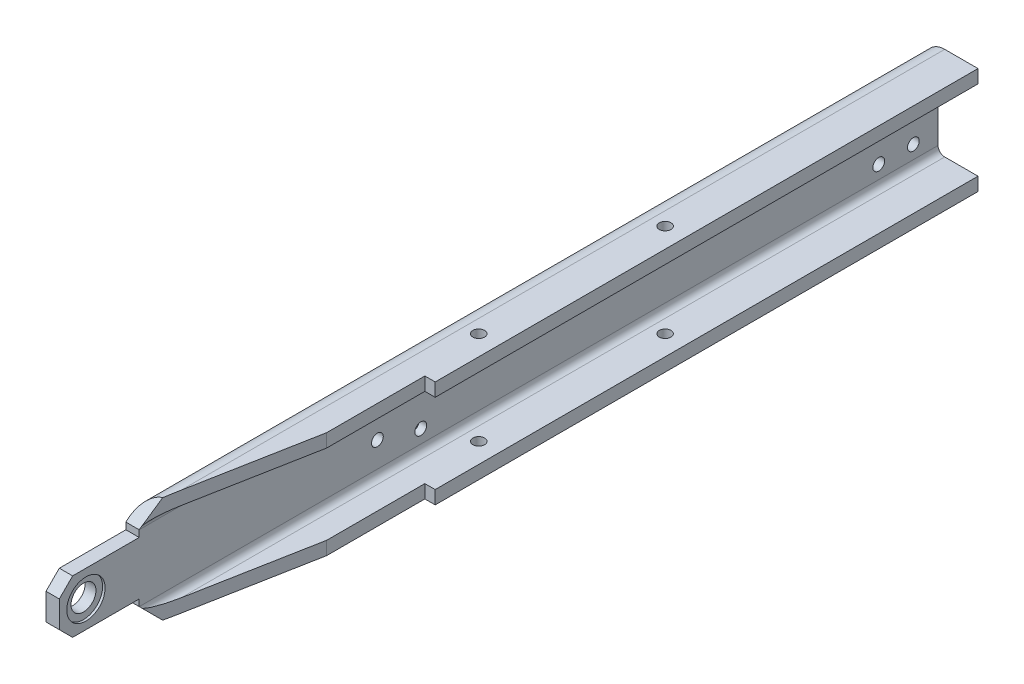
from build123d import *

# Parameters (mm, degrees)
BASE_EXTRUDE_DEPTH                                 = 431.8
SKETCH2_W                                          = 26.565487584
SKETCH2_H                                          = 13.18919361
SKETCH2_W_2                                        = 26.605763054
SKETCH2_H_2                                        = 13.278530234
CUT_EXTRUDE1_DEPTH                                 = 38.1
CUT_EXTRUDE2_DEPTH                                 = 436.519276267
SKETCH4_R                                          = 5.953125
CUT_EXTRUDE3_DEPTH                                 = 433.965705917
CHAMFER1_SIZE                                      = 6.35
CUT_EXTRUDE6_DEPTH                                 = 433.965705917
CUT_EXTRUDE6_DEPTH_BACK                            = 433.965705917
SKETCH6_R                                          = 2.794
FOAM_MOUNT_HOLES_DEPTH                             = 436.519276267
SKETCH7_R                                          = 9.1313
SKETCH7_R_2                                        = 4.7625
CONE_MOUNT_HOLES_DEPTH                             = 1.1684
SKETCH8_R                                          = 2.794
FRAME_MOUNT_HOLES_DEPTH                            = 434.291541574
SKETCH10_W                                         = 25.4
SKETCH10_H                                         = 12.7
SHORTEN_LENGTH_DEPTH                               = 436.519276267
CSK_FOR_10_FLAT_HEAD_SOCKET_CAP_SCREW1_D           = 5.6134
CSK_FOR_10_FLAT_HEAD_SOCKET_CAP_SCREW1_DEPTH       = 25.4
CSK_FOR_10_FLAT_HEAD_SOCKET_CAP_SCREW1_CSINK_D     = 10.4394
CSK_FOR_10_FLAT_HEAD_SOCKET_CAP_SCREW1_CSINK_ANGLE = 82
CSK_FOR_10_FLAT_HEAD_SOCKET_CAP_SCREW1_TIP         = 1.686435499
HOLE1_D                                            = 5.6134
HOLE1_DEPTH                                        = 25.4
HOLE1_CSINK_D                                      = 10.4394
HOLE1_CSINK_ANGLE                                  = 82
HOLE1_TIP                                          = 1.686435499
SKETCH16_R                                         = 2.8067
ELECBRKTMOUNT_DEPTH                                = 15.24
SKETCH17_R                                         = 2.8067
CUT_EXTRUDE7_DEPTH                                 = 433.965705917
CUT_EXTRUDE8_DEPTH                                 = 436.519276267


with BuildPart() as part:
    # Sketch1 → Base-Extrude (new body)
    with BuildSketch(Plane.XY):
        with BuildLine():
            Line((0, -15.875), (0, 15.875))
            ThreePointArc((0, 15.875), (2.789807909, 22.610192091), (9.525, 25.4))
            Line((9.525, 25.4), (25.4, 25.4))
            Line((25.4, 25.4), (25.4, 19.05))
            Line((25.4, 19.05), (9.525, 19.05))
            ThreePointArc((9.525, 19.05), (7.27993597, 18.12006403), (6.35, 15.875))
            Line((6.35, 15.875), (6.35, -15.875))
            ThreePointArc((6.35, -15.875), (7.27993597, -18.12006403), (9.525, -19.05))
            Line((9.525, -19.05), (25.4, -19.05))
            Line((25.4, -19.05), (25.4, -25.4))
            Line((25.4, -25.4), (9.525, -25.4))
            ThreePointArc((9.525, -25.4), (2.789807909, -22.610192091), (0, -15.875))
        make_face()
    extrude(amount=BASE_EXTRUDE_DEPTH)

    # Sketch2 → Cut-Extrude1 (cut)
    with BuildSketch(Plane.XY.offset(431.8)):
        with Locations((13.282743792, 19.294596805)):
            Rectangle(SKETCH2_W, SKETCH2_H)
        with Locations((13.302881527, -19.339265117)):
            Rectangle(SKETCH2_W_2, SKETCH2_H_2)
    extrude(amount=-CUT_EXTRUDE1_DEPTH, mode=Mode.SUBTRACT)

    # Sketch3 → Cut-Extrude2 (cut, through all)
    with BuildSketch(Plane(origin=(0, 25.4, 0), x_dir=(-1, 0, 0), z_dir=(0, 1, 0))):
        Polygon((-6.35, 393.7), (-25.4, 292.1), (-25.4, 393.7), align=None)
    extrude(amount=-CUT_EXTRUDE2_DEPTH, mode=Mode.SUBTRACT)

    # Sketch4 → Cut-Extrude3 (cut, through all)
    with BuildSketch(Plane(origin=(6.35, 0, 0), x_dir=(0, 0, -1), z_dir=(1, 0, 0))):
        with Locations((-419.1, 0)):
            Circle(SKETCH4_R)
    extrude(amount=-CUT_EXTRUDE3_DEPTH, mode=Mode.SUBTRACT)

    # Chamfer1
    chamfer1_edges = [part.edges().sort_by_distance(p)[0] for p in [
        (3.175, -12.7, 431.8),
        (3.175, 12.7, 431.8),
    ]]
    chamfer(chamfer1_edges, length=CHAMFER1_SIZE)

    # Sketch5 → Cut-Extrude6 (cut, two sides: drawn at the far end of the back side and taken through both)
    with BuildSketch(Plane(origin=(6.35, 0, 0), x_dir=(0, 0, -1), z_dir=(1, 0, 0)).offset(-CUT_EXTRUDE6_DEPTH_BACK)):
        Polygon((-393.7, 15.875), (-393.7, 28.575), (-381, 28.575), align=None)
        Polygon((-393.7, -15.875), (-393.7, -28.575), (-381, -28.575), align=None)
    extrude(amount=CUT_EXTRUDE6_DEPTH + CUT_EXTRUDE6_DEPTH_BACK, mode=Mode.SUBTRACT)

    # Sketch6 → foam mount holes (cut, through all)
    with BuildSketch(Plane.XZ.offset(25.4)):
        with Locations((15.875, 241.3)):
            Circle(SKETCH6_R)
        with Locations((15.875, 152.4)):
            Circle(SKETCH6_R)
    extrude(amount=-FOAM_MOUNT_HOLES_DEPTH, mode=Mode.SUBTRACT)

    # Sketch7 → cone mount holes (cut)
    with BuildSketch(Plane(origin=(6.35, 0, 0), x_dir=(0, 0, -1), z_dir=(1, 0, 0))):
        with Locations((-419.1, 0)):
            Circle(SKETCH7_R)
        with Locations((-419.1, 0)):
            Circle(SKETCH7_R_2, mode=Mode.SUBTRACT)
    extrude(amount=-CONE_MOUNT_HOLES_DEPTH, mode=Mode.SUBTRACT)

    # Sketch8 → frame mount holes (cut, through all)
    with BuildSketch(Plane.ZY):
        with Locations((259.419244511, 9.525)):
            Circle(SKETCH8_R)
        with Locations((259.419244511, -9.525)):
            Circle(SKETCH8_R)
        with Locations((24.469244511, 9.525)):
            Circle(SKETCH8_R)
        with Locations((24.469244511, -9.525)):
            Circle(SKETCH8_R)
    extrude(amount=-FRAME_MOUNT_HOLES_DEPTH, mode=Mode.SUBTRACT)

    # Sketch10 → shorten length (cut, through all)
    with BuildSketch(Plane(origin=(0, 25.4, 0), x_dir=(-1, 0, 0), z_dir=(0, 1, 0))):
        with Locations((-12.7, 6.35)):
            Rectangle(SKETCH10_W, SKETCH10_H)
    extrude(amount=-SHORTEN_LENGTH_DEPTH, mode=Mode.SUBTRACT)

    # CSK for _10 Flat Head Socket Cap Screw1
    with Locations(Plane.ZY):
        with Locations((259.419244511, 9.525)):
            CounterSinkHole(CSK_FOR_10_FLAT_HEAD_SOCKET_CAP_SCREW1_D / 2, CSK_FOR_10_FLAT_HEAD_SOCKET_CAP_SCREW1_CSINK_D / 2, depth=CSK_FOR_10_FLAT_HEAD_SOCKET_CAP_SCREW1_DEPTH, counter_sink_angle=CSK_FOR_10_FLAT_HEAD_SOCKET_CAP_SCREW1_CSINK_ANGLE)
            with Locations((0, 0, -(CSK_FOR_10_FLAT_HEAD_SOCKET_CAP_SCREW1_DEPTH + CSK_FOR_10_FLAT_HEAD_SOCKET_CAP_SCREW1_TIP / 2))):  # 118° drill point
                Cone(0, CSK_FOR_10_FLAT_HEAD_SOCKET_CAP_SCREW1_D / 2, CSK_FOR_10_FLAT_HEAD_SOCKET_CAP_SCREW1_TIP, mode=Mode.SUBTRACT)

    # Hole1
    with Locations(Plane(origin=(0, -14.130660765, -8.327817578), x_dir=(0, 0, 1), z_dir=(-1, 0, 0))):
        with Locations((267.747062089, 4.605660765)):
            CounterSinkHole(HOLE1_D / 2, HOLE1_CSINK_D / 2, depth=HOLE1_DEPTH, counter_sink_angle=HOLE1_CSINK_ANGLE)
            with Locations((0, 0, -(HOLE1_DEPTH + HOLE1_TIP / 2))):  # 118° drill point
                Cone(0, HOLE1_D / 2, HOLE1_TIP, mode=Mode.SUBTRACT)

    # Sketch16 → ElecBrktMount (cut)
    with BuildSketch(Plane(origin=(6.35, 0, 0), x_dir=(0, 0, -1), z_dir=(1, 0, 0))):
        with Locations((-280.0985, -3.81)):
            Circle(SKETCH16_R)
    extrude(amount=-ELECBRKTMOUNT_DEPTH, mode=Mode.SUBTRACT)

    # Sketch17 → Cut-Extrude7 (cut, through all)
    with BuildSketch(Plane(origin=(6.35, 0, 0), x_dir=(0, 0, -1), z_dir=(1, 0, 0))):
        with Locations(Location((-40.979244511, -9.525, 0), (0, 0, 90))):
            Circle(SKETCH17_R)
        with Locations(Location((-40.979244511, 9.525, 0), (0, 0, 89.999999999))):
            Circle(SKETCH17_R)
    extrude(amount=-CUT_EXTRUDE7_DEPTH, mode=Mode.SUBTRACT)

    # Sketch18 → Cut-Extrude8 (cut, through all)
    with BuildSketch(Plane(origin=(0, 25.4, 0), x_dir=(-1, 0, 0), z_dir=(0, 1, 0))):
        Polygon((-25.4, 271.578943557), (-20.469079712, 271.578943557), (-20.469079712, 318.398241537), (-25.4, 292.1), align=None)
    extrude(amount=-CUT_EXTRUDE8_DEPTH, mode=Mode.SUBTRACT)


solid = part.part
